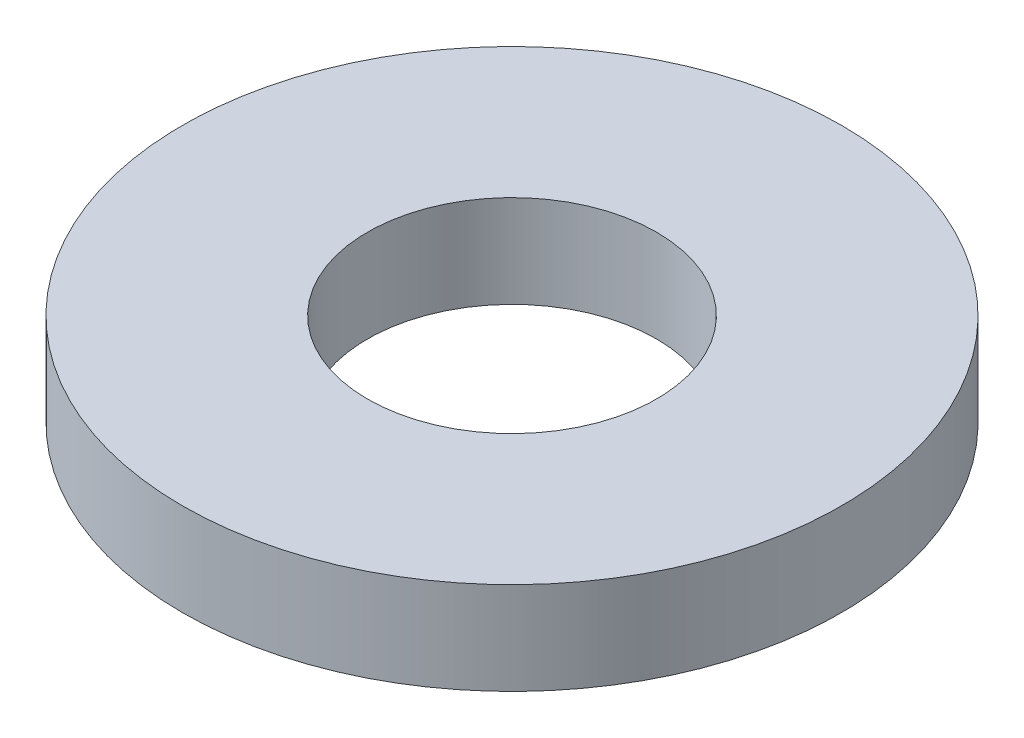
from build123d import *

# Parameters (mm, degrees)
SKETCH1_R           = 9.04875
SKETCH1_R_2         = 3.96875
BOSS_EXTRUDE1_DEPTH = 2.54


with BuildPart() as part:
    # Sketch1 → Boss-Extrude1 (new body)
    with BuildSketch(Plane(origin=(0, 0, 0), x_dir=(1, 0, 0), z_dir=(0, 1, 0))):
        with Locations(Location((0, 0, 0), (0, 0, 270))):
            Circle(SKETCH1_R)
        with Locations(Location((0, 0, 0), (0, 0, 270))):
            Circle(SKETCH1_R_2, mode=Mode.SUBTRACT)
    extrude(amount=BOSS_EXTRUDE1_DEPTH)


solid = part.part
